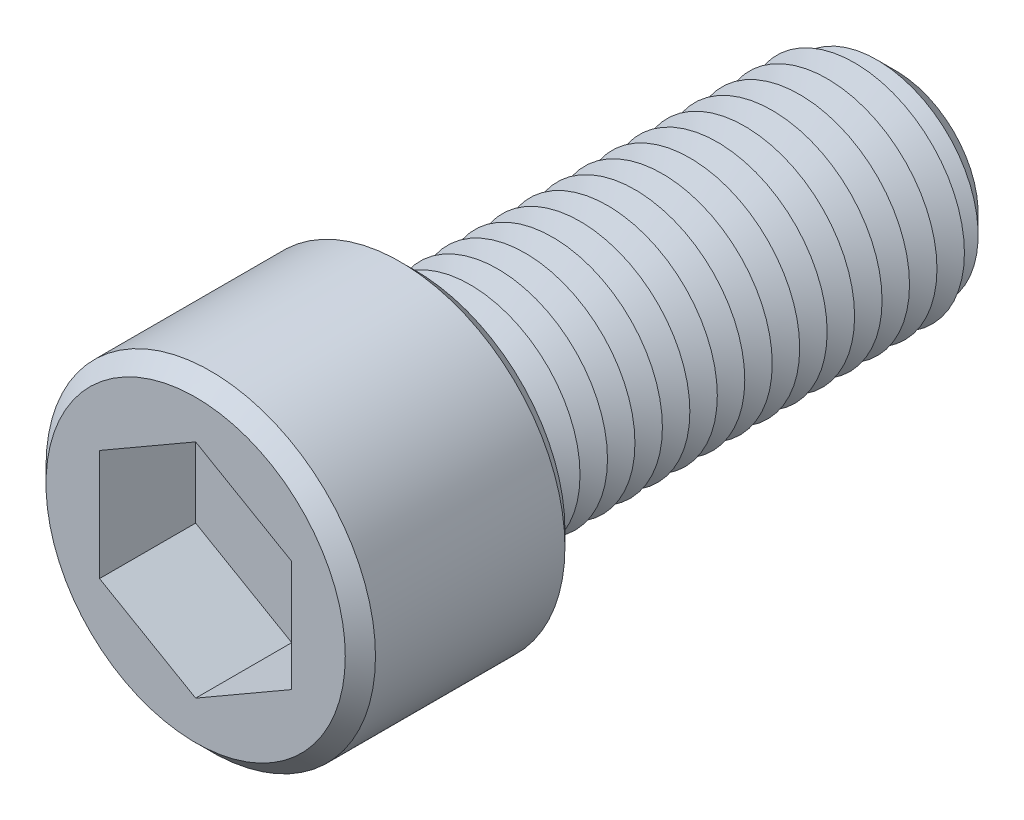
from build123d import *

# Parameters (mm, degrees)
SKETCH1_R           = 12
BOSS_EXTRUDE1_DEPTH = 16
SKETCH2_R           = 8
BOSS_EXTRUDE2_DEPTH = 35
CHAMFER1_SIZE       = 2
LPATTERN1_COUNT     = 17
LPATTERN1_PITCH     = 2
CUT_EXTRUDE1_DEPTH  = 7
SKETCH6_R           = 0.9
CUT_EXTRUDE2_DEPTH  = 44
CHAMFER2_SIZE       = 1.1


with BuildPart() as part:
    # Sketch1 → Boss-Extrude1 (new body)
    with BuildSketch(Plane.XY):
        Circle(SKETCH1_R)
    extrude(amount=BOSS_EXTRUDE1_DEPTH)

    # Sketch2 → Boss-Extrude2 (add)
    with BuildSketch(Plane(origin=(0, 0, 0), x_dir=(-1, 0, 0), z_dir=(0, 0, -1))):
        Circle(SKETCH2_R)
    extrude(amount=BOSS_EXTRUDE2_DEPTH)

    # Chamfer1
    chamfer1_edges = [part.edges().sort_by_distance(p)[0] for p in [
        (8, 0, -35),
    ]]
    chamfer(chamfer1_edges, length=CHAMFER1_SIZE)

    # Sketch4 → Cut-Revolve1 (revolve, cut)
    with BuildSketch(Plane(origin=(0, 0, 0), x_dir=(0, 0, -1), z_dir=(1, 0, 0)), mode=Mode.PRIVATE) as cut_revolve1_sk:
        Polygon((0, 8), (1, 6.267949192), (2, 8), align=None)
    cut_revolve1 = revolve(cut_revolve1_sk.sketch.rotate(Axis((0, 0, 2.512122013), (0, 0, -1)), 90), axis=Axis((0, 0, 2.512122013), (0, 0, -1)), mode=Mode.SUBTRACT)

    # LPattern1: Cut-Revolve1 ×17
    with Locations(*[(0, 0, -i * LPATTERN1_PITCH) for i in range(1, LPATTERN1_COUNT)]):
        add(cut_revolve1, mode=Mode.SUBTRACT)

    # Sketch5 → Cut-Extrude1 (cut)
    with BuildSketch(Plane.XY.offset(16)):
        Polygon((0, 8.082903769), (-7, 4.041451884), (-7, -4.041451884), (0, -8.082903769), (7, -4.041451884), (7, 4.041451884), align=None)
    extrude(amount=-CUT_EXTRUDE1_DEPTH, mode=Mode.SUBTRACT)

    # Sketch6 → Cut-Extrude2 (cut)
    with BuildSketch(Plane.XY.offset(9)):
        Circle(SKETCH6_R)
    extrude(amount=-CUT_EXTRUDE2_DEPTH, mode=Mode.SUBTRACT)

    # Chamfer2
    chamfer2_edges = [part.edges().sort_by_distance(p)[0] for p in [
        (-12, 0, 0),
        (-12, 0, 16),
    ]]
    chamfer(chamfer2_edges, length=CHAMFER2_SIZE)


solid = part.part
